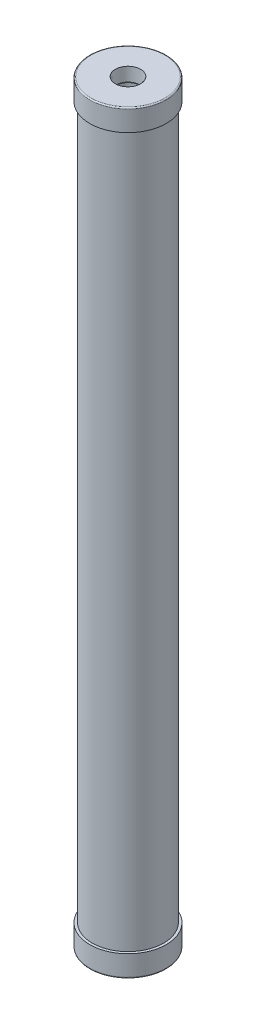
from build123d import *

# Parameters (mm, degrees)
SKETCH1_R           = 44.45
SKETCH1_R_2         = 38.6334
BOSS_EXTRUDE1_DEPTH = 939.8
SKETCH2_R           = 47.625
BOSS_EXTRUDE2_DEPTH = 26.924
BOSS_EXTRUDE3_START = -26.924
SKETCH5_R           = 47.625
BOSS_EXTRUDE3_DEPTH = 26.924
FILLET1_R           = 1.524


with BuildPart() as part:
    # Sketch1 → Boss-Extrude1 (new body)
    with BuildSketch(Plane(origin=(0, 0, 0), x_dir=(1, 0, 0), z_dir=(0, 1, 0))):
        with Locations(Location((0, 0, 0), (0, 0, 270))):
            Circle(SKETCH1_R)
        with Locations(Location((0, 0, 0), (0, 0, 270))):
            Circle(SKETCH1_R_2, mode=Mode.SUBTRACT)
    extrude(amount=BOSS_EXTRUDE1_DEPTH)

    # Sketch2 → Boss-Extrude2 (add)
    with BuildSketch(Plane(origin=(0, 0, 0), x_dir=(1, 0, 0), z_dir=(0, 1, 0))):
        with Locations(Location((0, 0, 0), (0, 0, 270))):
            Circle(SKETCH2_R)
    extrude(amount=BOSS_EXTRUDE2_DEPTH)

    # Sketch3 → 1 NPT Tapped Hole1 (revolve, cut)
    with BuildSketch(Plane(origin=(0, 0, 0), x_dir=(0, 0, -1), z_dir=(1, 0, 0))):
        Polygon((0, 0), (0, 36.646890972), (14.4907, 27.94), (14.4907, 16.764), (15.22797859, 16.764), (15.7299152, 0), align=None)
    revolve(axis=Axis((0, -6.35, 0), (0, 1, 0)), mode=Mode.SUBTRACT)

    # Sketch5 → Boss-Extrude3 (add)
    with BuildSketch(Plane(origin=(0, 939.8, 0), x_dir=(1, 0, 0), z_dir=(0, 1, 0)).offset(BOSS_EXTRUDE3_START)):
        with Locations(Location((0, 0, 0), (0, 0, 270))):
            Circle(SKETCH5_R)
    extrude(amount=BOSS_EXTRUDE3_DEPTH)

    # Sketch6 → 1 NPT Tapped Hole2 (revolve, cut)
    with BuildSketch(Plane(origin=(0, 939.8, 0), x_dir=(0, 0, 1), z_dir=(1, 0, 0))):
        Polygon((0, 0), (0, 36.646890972), (14.4907, 27.94), (14.4907, 16.764), (15.22797859, 16.764), (15.7299152, 0), align=None)
    revolve(axis=Axis((0, 946.15, 0), (0, -1, 0)), mode=Mode.SUBTRACT)

    # Fillet1
    fillet1_edges = [part.edges().sort_by_distance(p)[0] for p in [
        (0, 0, -47.625),
        (0, 939.8, -47.625),
    ]]
    fillet(fillet1_edges, radius=FILLET1_R)


solid = part.part
